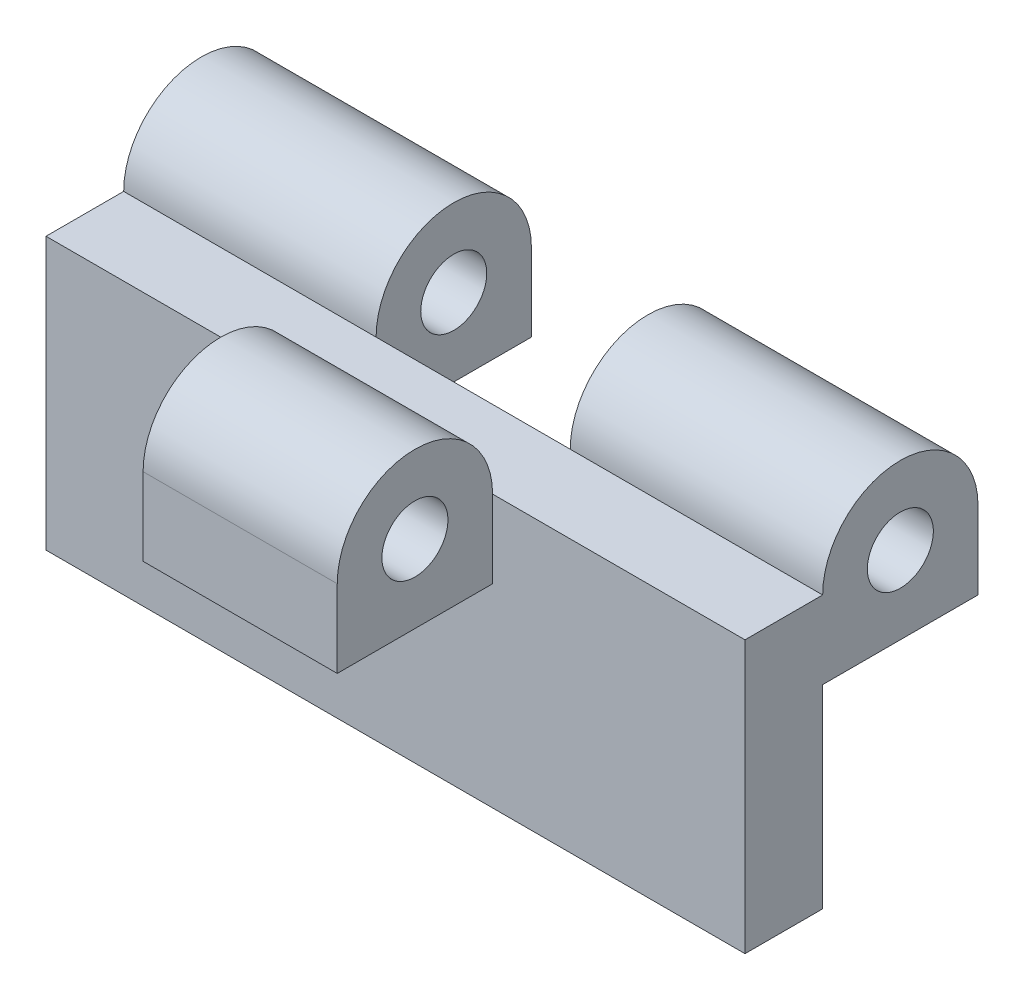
from build123d import *

# Parameters (mm, degrees)
SKETCH1_W           = 18
SKETCH1_H           = 10
BOSS_EXTRUDE1_DEPTH = 4
SKETCH3_W           = 5
SKETCH3_H           = 4
CUT_EXTRUDE1_DEPTH  = 4
SKETCH4_W           = 6.5
SKETCH4_H           = 4
CUT_EXTRUDE2_DEPTH  = 4
CUT_EXTRUDE6_DEPTH  = 20
SKETCH10_R          = 0.85
CUT_EXTRUDE9_DEPTH  = 20
SKETCH11_W          = 2
SKETCH11_H          = 2
CUT_EXTRUDE10_DEPTH = 20
SKETCH12_W          = 18
SKETCH12_H          = 2
BOSS_EXTRUDE2_DEPTH = 5


with BuildPart() as part:
    # Sketch1 → Boss-Extrude1 (new body)
    with BuildSketch(Plane(origin=(0, 0, 0), x_dir=(1, 0, 0), z_dir=(0, 1, 0))):
        with Locations((-17.486617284, 1)):
            Rectangle(SKETCH1_W, SKETCH1_H)
    extrude(amount=BOSS_EXTRUDE1_DEPTH)

    # Sketch3 → Cut-Extrude1 (cut)
    with BuildSketch(Plane(origin=(0, 4, 0), x_dir=(1, 0, 0), z_dir=(0, 1, 0))):
        with Locations((-17.486617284, 4)):
            Rectangle(SKETCH3_W, SKETCH3_H)
    extrude(amount=-CUT_EXTRUDE1_DEPTH, mode=Mode.SUBTRACT)

    # Sketch4 → Cut-Extrude2 (cut)
    with BuildSketch(Plane(origin=(0, 4, 0), x_dir=(1, 0, 0), z_dir=(0, 1, 0))):
        with Locations((-23.236617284, -2)):
            Rectangle(SKETCH4_W, SKETCH4_H)
        with Locations((-11.736617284, -2)):
            Rectangle(SKETCH4_W, SKETCH4_H)
    extrude(amount=-CUT_EXTRUDE2_DEPTH, mode=Mode.SUBTRACT)

    # Sketch7 → Cut-Extrude6 (cut)
    with BuildSketch(Plane.ZY.offset(19.986617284)):
        with BuildLine():
            ThreePointArc((0.585786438, 3.414213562), (1.234633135, 3.847759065), (2, 4))
            Line((2, 4), (0, 4))
            Line((0, 4), (0.585786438, 3.414213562))
        make_face()
        with BuildLine():
            ThreePointArc((0, 2), (0.152240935, 2.765366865), (0.585786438, 3.414213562))
            Line((0.585786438, 3.414213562), (0, 4))
            Line((0, 4), (0, 2))
        make_face()
        with BuildLine():
            ThreePointArc((2, 4), (3.414213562, 3.414213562), (4, 2))
            Line((4, 2), (4, 4))
            Line((4, 4), (2, 4))
        make_face()
        with BuildLine():
            ThreePointArc((1.398959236, 2.601040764), (1.398959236, 1.398959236), (2.601040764, 1.398959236))
            Line((2.601040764, 1.398959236), (1.398959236, 2.601040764))
        make_face()
        with BuildLine():
            Line((1.398959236, 2.601040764), (2.601040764, 1.398959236))
            ThreePointArc((2.601040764, 1.398959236), (2.785297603, 1.674719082), (2.85, 2))
            ThreePointArc((2.85, 2), (2.325280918, 2.785297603), (1.398959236, 2.601040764))
        make_face()
        with BuildLine():
            ThreePointArc((1.398959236, 2.601040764), (1.398959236, 1.398959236), (2.601040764, 1.398959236))
            Line((2.601040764, 1.398959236), (1.398959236, 2.601040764))
        make_face()
        with BuildLine():
            Line((1.398959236, 2.601040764), (2.601040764, 1.398959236))
            ThreePointArc((2.601040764, 1.398959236), (2.785297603, 1.674719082), (2.85, 2))
            ThreePointArc((2.85, 2), (2.325280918, 2.785297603), (1.398959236, 2.601040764))
        make_face()
    extrude(amount=-CUT_EXTRUDE6_DEPTH, mode=Mode.SUBTRACT)

    # Sketch10 → Cut-Extrude9 (cut)
    with BuildSketch(Plane.ZY.offset(26.486617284)):
        with BuildLine():
            ThreePointArc((-6, 2), (-5.414213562, 3.414213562), (-4, 4))
            Line((-4, 4), (-6, 4))
            Line((-6, 4), (-6, 2))
        make_face()
        with BuildLine():
            ThreePointArc((-4, 4), (-2.585786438, 3.414213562), (-2, 2))
            Line((-2, 2), (-2, 4))
            Line((-2, 4), (-4, 4))
        make_face()
        with Locations((-4, 2)):
            Circle(SKETCH10_R)
    extrude(amount=-CUT_EXTRUDE9_DEPTH, mode=Mode.SUBTRACT)

    # Sketch11 → Cut-Extrude10 (cut)
    with BuildSketch(Plane.ZY.offset(26.486617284)):
        with Locations((-1, 3)):
            Rectangle(SKETCH11_W, SKETCH11_H)
    extrude(amount=-CUT_EXTRUDE10_DEPTH, mode=Mode.SUBTRACT)

    # Sketch12 → Boss-Extrude2 (add)
    with BuildSketch(Plane.XZ):
        with Locations((-17.486617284, -1)):
            Rectangle(SKETCH12_W, SKETCH12_H)
    extrude(amount=BOSS_EXTRUDE2_DEPTH)


solid = part.part
